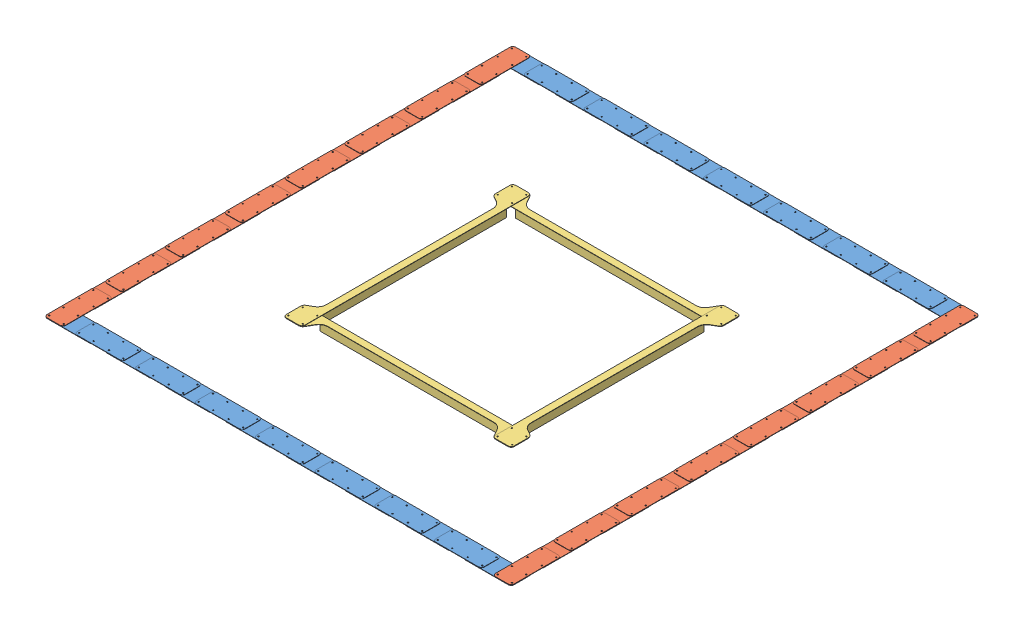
SolidWorks assembly Conct full Array w14x90 20210729 H5.SLDASM, configuration Default (file format 14000). Lengths in mm.
Overall size (17449.89 431.8 17515.17).
176 component instances, 4 part files, 54 mates.
Components (placement in the parent):
- Conct plate w14x90 20210729 H5-2: Conct plate w14x90 20210729 H5.SLDASM [mid frt 1] at (-8378.825 -12.7 8378.825) size (2926.6 25.4 757.52)
  - Plate connect 1 20210527 w193 cH3 H4 H5-1: Plate connect 1 20210527 w193 cH3 H4 H5.SLDPRT [full plate] at (0 -12.7 0) size (1809.42 12.7 757.52)
  - Plate connect 2 20210527 w193 cH3 H4 H5-1: Plate connect 2 20210527 w193 cH3 H4 H5.SLDPRT [full plate] at origin (suppressed, hidden)
  - Plate connect 1 20210527 w193 cH3 H4 H5-2: Plate connect 1 20210527 w193 cH3 H4 H5.SLDPRT [full plate] at (1117.1767 0 0) size (1809.42 12.7 757.52)
  - Shim Plate conct 1 20210527 w193 cH3 H4 H5-2: Shim Plate conct 1 20210527 w193 cH3 H4 H5.SLDPRT [0.5] at (2613.8943 288.3718 -753.4145) (suppressed, hidden)
  - Plate connect 2 20210527 w193 cH3 H4 H5-2: Plate connect 2 20210527 w193 cH3 H4 H5.SLDPRT [full plate] at (0 -12.7 -1117.1767) (suppressed, hidden)
- Conct plate w14x90 20210729 H5-7: Conct plate w14x90 20210729 H5.SLDASM [mid frt 1] at (-6144.4717 -12.7 8378.825) size (2926.6 25.4 757.52)
  - Plate connect 1 20210527 w193 cH3 H4 H5-1: Plate connect 1 20210527 w193 cH3 H4 H5.SLDPRT [full plate] at (0 -12.7 0) size (1809.42 12.7 757.52)
  - Plate connect 2 20210527 w193 cH3 H4 H5-1: Plate connect 2 20210527 w193 cH3 H4 H5.SLDPRT [full plate] at origin (suppressed, hidden)
  - Plate connect 1 20210527 w193 cH3 H4 H5-2: Plate connect 1 20210527 w193 cH3 H4 H5.SLDPRT [full plate] at (1117.1767 0 0) size (1809.42 12.7 757.52)
  - Shim Plate conct 1 20210527 w193 cH3 H4 H5-2: Shim Plate conct 1 20210527 w193 cH3 H4 H5.SLDPRT [0.5] at (2613.8943 288.3718 -753.4145) (suppressed, hidden)
  - Plate connect 2 20210527 w193 cH3 H4 H5-2: Plate connect 2 20210527 w193 cH3 H4 H5.SLDPRT [full plate] at (0 -12.7 -1117.1767) (suppressed, hidden)
- Conct plate w14x90 20210729 H5-8: Conct plate w14x90 20210729 H5.SLDASM [mid frt 1] at (-3910.1183 -12.7 8378.825) size (2926.6 25.4 757.52)
  - Plate connect 1 20210527 w193 cH3 H4 H5-1: Plate connect 1 20210527 w193 cH3 H4 H5.SLDPRT [full plate] at (0 -12.7 0) size (1809.42 12.7 757.52)
  - Plate connect 2 20210527 w193 cH3 H4 H5-1: Plate connect 2 20210527 w193 cH3 H4 H5.SLDPRT [full plate] at origin (suppressed, hidden)
  - Plate connect 1 20210527 w193 cH3 H4 H5-2: Plate connect 1 20210527 w193 cH3 H4 H5.SLDPRT [full plate] at (1117.1767 0 0) size (1809.42 12.7 757.52)
  - Shim Plate conct 1 20210527 w193 cH3 H4 H5-2: Shim Plate conct 1 20210527 w193 cH3 H4 H5.SLDPRT [0.5] at (2613.8943 288.3718 -753.4145) (suppressed, hidden)
  - Plate connect 2 20210527 w193 cH3 H4 H5-2: Plate connect 2 20210527 w193 cH3 H4 H5.SLDPRT [full plate] at (0 -12.7 -1117.1767) (suppressed, hidden)
- Conct plate w14x90 20210729 H5-9: Conct plate w14x90 20210729 H5.SLDASM [mid frt 1] at (-1675.765 -12.7 8378.825) size (2926.6 25.4 757.52)
  - Plate connect 1 20210527 w193 cH3 H4 H5-1: Plate connect 1 20210527 w193 cH3 H4 H5.SLDPRT [full plate] at (0 -12.7 0) size (1809.42 12.7 757.52)
  - Plate connect 2 20210527 w193 cH3 H4 H5-1: Plate connect 2 20210527 w193 cH3 H4 H5.SLDPRT [full plate] at origin (suppressed, hidden)
  - Plate connect 1 20210527 w193 cH3 H4 H5-2: Plate connect 1 20210527 w193 cH3 H4 H5.SLDPRT [full plate] at (1117.1767 0 0) size (1809.42 12.7 757.52)
  - Shim Plate conct 1 20210527 w193 cH3 H4 H5-2: Shim Plate conct 1 20210527 w193 cH3 H4 H5.SLDPRT [0.5] at (2613.8943 288.3718 -753.4145) (suppressed, hidden)
  - Plate connect 2 20210527 w193 cH3 H4 H5-2: Plate connect 2 20210527 w193 cH3 H4 H5.SLDPRT [full plate] at (0 -12.7 -1117.1767) (suppressed, hidden)
- Conct plate w14x90 20210729 H5-10: Conct plate w14x90 20210729 H5.SLDASM [mid frt 1] at (558.5883 -12.7 8378.825) size (2926.6 25.4 757.52)
  - Plate connect 1 20210527 w193 cH3 H4 H5-1: Plate connect 1 20210527 w193 cH3 H4 H5.SLDPRT [full plate] at (0 -12.7 0) size (1809.42 12.7 757.52)
  - Plate connect 2 20210527 w193 cH3 H4 H5-1: Plate connect 2 20210527 w193 cH3 H4 H5.SLDPRT [full plate] at origin (suppressed, hidden)
  - Plate connect 1 20210527 w193 cH3 H4 H5-2: Plate connect 1 20210527 w193 cH3 H4 H5.SLDPRT [full plate] at (1117.1767 0 0) size (1809.42 12.7 757.52)
  - Shim Plate conct 1 20210527 w193 cH3 H4 H5-2: Shim Plate conct 1 20210527 w193 cH3 H4 H5.SLDPRT [0.5] at (2613.8943 288.3718 -753.4145) (suppressed, hidden)
  - Plate connect 2 20210527 w193 cH3 H4 H5-2: Plate connect 2 20210527 w193 cH3 H4 H5.SLDPRT [full plate] at (0 -12.7 -1117.1767) (suppressed, hidden)
- Conct plate w14x90 20210729 H5-11: Conct plate w14x90 20210729 H5.SLDASM [mid frt 1] at (2792.9417 -12.7 8378.825) size (2926.6 25.4 757.52)
  - Plate connect 1 20210527 w193 cH3 H4 H5-1: Plate connect 1 20210527 w193 cH3 H4 H5.SLDPRT [full plate] at (0 -12.7 0) size (1809.42 12.7 757.52)
  - Plate connect 2 20210527 w193 cH3 H4 H5-1: Plate connect 2 20210527 w193 cH3 H4 H5.SLDPRT [full plate] at origin (suppressed, hidden)
  - Plate connect 1 20210527 w193 cH3 H4 H5-2: Plate connect 1 20210527 w193 cH3 H4 H5.SLDPRT [full plate] at (1117.1767 0 0) size (1809.42 12.7 757.52)
  - Shim Plate conct 1 20210527 w193 cH3 H4 H5-2: Shim Plate conct 1 20210527 w193 cH3 H4 H5.SLDPRT [0.5] at (2613.8943 288.3718 -753.4145) (suppressed, hidden)
  - Plate connect 2 20210527 w193 cH3 H4 H5-2: Plate connect 2 20210527 w193 cH3 H4 H5.SLDPRT [full plate] at (0 -12.7 -1117.1767) (suppressed, hidden)
- Conct plate w14x90 20210729 H5-12: Conct plate w14x90 20210729 H5.SLDASM [mid frt 1] at (5027.295 -12.7 8378.825) size (2926.6 25.4 757.52)
  - Plate connect 1 20210527 w193 cH3 H4 H5-1: Plate connect 1 20210527 w193 cH3 H4 H5.SLDPRT [full plate] at (0 -12.7 0) size (1809.42 12.7 757.52)
  - Plate connect 2 20210527 w193 cH3 H4 H5-1: Plate connect 2 20210527 w193 cH3 H4 H5.SLDPRT [full plate] at origin (suppressed, hidden)
  - Plate connect 1 20210527 w193 cH3 H4 H5-2: Plate connect 1 20210527 w193 cH3 H4 H5.SLDPRT [full plate] at (1117.1767 0 0) size (1809.42 12.7 757.52)
  - Shim Plate conct 1 20210527 w193 cH3 H4 H5-2: Shim Plate conct 1 20210527 w193 cH3 H4 H5.SLDPRT [0.5] at (2613.8943 288.3718 -753.4145) (suppressed, hidden)
  - Plate connect 2 20210527 w193 cH3 H4 H5-2: Plate connect 2 20210527 w193 cH3 H4 H5.SLDPRT [full plate] at (0 -12.7 -1117.1767) (suppressed, hidden)
- Plate connect 1 20210527 w193 cH3 H4 H5-1: Plate connect 1 20210527 w193 cH3 H4 H5.SLDPRT [full plate] at (7261.6483 -25.4 8378.825) size (1809.42 12.7 757.52)
- Conct plate w14x90 20210729 H5-19: Conct plate w14x90 20210729 H5.SLDASM [side 1] at (-8378.825 -12.7 8378.825) size (692.24 25.4 2991.88)
  - Plate connect 1 20210527 w193 cH3 H4 H5-1: Plate connect 1 20210527 w193 cH3 H4 H5.SLDPRT [full plate] at (0 -12.7 0) size (1809.42 12.7 757.52) (suppressed, hidden)
  - Plate connect 2 20210527 w193 cH3 H4 H5-1: Plate connect 2 20210527 w193 cH3 H4 H5.SLDPRT [full plate] at origin
  - Plate connect 1 20210527 w193 cH3 H4 H5-2: Plate connect 1 20210527 w193 cH3 H4 H5.SLDPRT [full plate] at (1117.1767 0 0) size (1809.42 12.7 757.52) (suppressed, hidden)
  - Shim Plate conct 1 20210527 w193 cH3 H4 H5-2: Shim Plate conct 1 20210527 w193 cH3 H4 H5.SLDPRT [0.5] at (2613.8943 288.3718 -753.4145) (suppressed, hidden)
  - Plate connect 2 20210527 w193 cH3 H4 H5-2: Plate connect 2 20210527 w193 cH3 H4 H5.SLDPRT [full plate] at (0 -12.7 -1117.1767)
- Conct plate w14x90 20210729 H5-20: Conct plate w14x90 20210729 H5.SLDASM [side 1] at (8378.825 -12.7 8378.825) size (692.24 25.4 2991.88)
  - Plate connect 1 20210527 w193 cH3 H4 H5-1: Plate connect 1 20210527 w193 cH3 H4 H5.SLDPRT [full plate] at (0 -12.7 0) size (1809.42 12.7 757.52) (suppressed, hidden)
  - Plate connect 2 20210527 w193 cH3 H4 H5-1: Plate connect 2 20210527 w193 cH3 H4 H5.SLDPRT [full plate] at origin
  - Plate connect 1 20210527 w193 cH3 H4 H5-2: Plate connect 1 20210527 w193 cH3 H4 H5.SLDPRT [full plate] at (1117.1767 0 0) size (1809.42 12.7 757.52) (suppressed, hidden)
  - Shim Plate conct 1 20210527 w193 cH3 H4 H5-2: Shim Plate conct 1 20210527 w193 cH3 H4 H5.SLDPRT [0.5] at (2613.8943 288.3718 -753.4145) (suppressed, hidden)
  - Plate connect 2 20210527 w193 cH3 H4 H5-2: Plate connect 2 20210527 w193 cH3 H4 H5.SLDPRT [full plate] at (0 -12.7 -1117.1767)
- Conct plate w14x90 20210729 H5-21: Conct plate w14x90 20210729 H5.SLDASM [side 1] at (8378.825 -12.7 6144.4717) size (692.24 25.4 2991.88)
  - Plate connect 1 20210527 w193 cH3 H4 H5-1: Plate connect 1 20210527 w193 cH3 H4 H5.SLDPRT [full plate] at (0 -12.7 0) size (1809.42 12.7 757.52) (suppressed, hidden)
  - Plate connect 2 20210527 w193 cH3 H4 H5-1: Plate connect 2 20210527 w193 cH3 H4 H5.SLDPRT [full plate] at origin
  - Plate connect 1 20210527 w193 cH3 H4 H5-2: Plate connect 1 20210527 w193 cH3 H4 H5.SLDPRT [full plate] at (1117.1767 0 0) size (1809.42 12.7 757.52) (suppressed, hidden)
  - Shim Plate conct 1 20210527 w193 cH3 H4 H5-2: Shim Plate conct 1 20210527 w193 cH3 H4 H5.SLDPRT [0.5] at (2613.8943 288.3718 -753.4145) (suppressed, hidden)
  - Plate connect 2 20210527 w193 cH3 H4 H5-2: Plate connect 2 20210527 w193 cH3 H4 H5.SLDPRT [full plate] at (0 -12.7 -1117.1767)
- Conct plate w14x90 20210729 H5-22: Conct plate w14x90 20210729 H5.SLDASM [side 1] at (8378.825 -12.7 3910.1183) size (692.24 25.4 2991.88)
  - Plate connect 1 20210527 w193 cH3 H4 H5-1: Plate connect 1 20210527 w193 cH3 H4 H5.SLDPRT [full plate] at (0 -12.7 0) size (1809.42 12.7 757.52) (suppressed, hidden)
  - Plate connect 2 20210527 w193 cH3 H4 H5-1: Plate connect 2 20210527 w193 cH3 H4 H5.SLDPRT [full plate] at origin
  - Plate connect 1 20210527 w193 cH3 H4 H5-2: Plate connect 1 20210527 w193 cH3 H4 H5.SLDPRT [full plate] at (1117.1767 0 0) size (1809.42 12.7 757.52) (suppressed, hidden)
  - Shim Plate conct 1 20210527 w193 cH3 H4 H5-2: Shim Plate conct 1 20210527 w193 cH3 H4 H5.SLDPRT [0.5] at (2613.8943 288.3718 -753.4145) (suppressed, hidden)
  - Plate connect 2 20210527 w193 cH3 H4 H5-2: Plate connect 2 20210527 w193 cH3 H4 H5.SLDPRT [full plate] at (0 -12.7 -1117.1767)
- Conct plate w14x90 20210729 H5-23: Conct plate w14x90 20210729 H5.SLDASM [side 1] at (8378.825 -12.7 1675.765) size (692.24 25.4 2991.88)
  - Plate connect 1 20210527 w193 cH3 H4 H5-1: Plate connect 1 20210527 w193 cH3 H4 H5.SLDPRT [full plate] at (0 -12.7 0) size (1809.42 12.7 757.52) (suppressed, hidden)
  - Plate connect 2 20210527 w193 cH3 H4 H5-1: Plate connect 2 20210527 w193 cH3 H4 H5.SLDPRT [full plate] at origin
  - Plate connect 1 20210527 w193 cH3 H4 H5-2: Plate connect 1 20210527 w193 cH3 H4 H5.SLDPRT [full plate] at (1117.1767 0 0) size (1809.42 12.7 757.52) (suppressed, hidden)
  - Shim Plate conct 1 20210527 w193 cH3 H4 H5-2: Shim Plate conct 1 20210527 w193 cH3 H4 H5.SLDPRT [0.5] at (2613.8943 288.3718 -753.4145) (suppressed, hidden)
  - Plate connect 2 20210527 w193 cH3 H4 H5-2: Plate connect 2 20210527 w193 cH3 H4 H5.SLDPRT [full plate] at (0 -12.7 -1117.1767)
- Conct plate w14x90 20210729 H5-24: Conct plate w14x90 20210729 H5.SLDASM [side 1] at (8378.825 -12.7 -558.5883) size (692.24 25.4 2991.88)
  - Plate connect 1 20210527 w193 cH3 H4 H5-1: Plate connect 1 20210527 w193 cH3 H4 H5.SLDPRT [full plate] at (0 -12.7 0) size (1809.42 12.7 757.52) (suppressed, hidden)
  - Plate connect 2 20210527 w193 cH3 H4 H5-1: Plate connect 2 20210527 w193 cH3 H4 H5.SLDPRT [full plate] at origin
  - Plate connect 1 20210527 w193 cH3 H4 H5-2: Plate connect 1 20210527 w193 cH3 H4 H5.SLDPRT [full plate] at (1117.1767 0 0) size (1809.42 12.7 757.52) (suppressed, hidden)
  - Shim Plate conct 1 20210527 w193 cH3 H4 H5-2: Shim Plate conct 1 20210527 w193 cH3 H4 H5.SLDPRT [0.5] at (2613.8943 288.3718 -753.4145) (suppressed, hidden)
  - Plate connect 2 20210527 w193 cH3 H4 H5-2: Plate connect 2 20210527 w193 cH3 H4 H5.SLDPRT [full plate] at (0 -12.7 -1117.1767)
- Conct plate w14x90 20210729 H5-25: Conct plate w14x90 20210729 H5.SLDASM [side 1] at (8378.825 -12.7 -2792.9417) size (692.24 25.4 2991.88)
  - Plate connect 1 20210527 w193 cH3 H4 H5-1: Plate connect 1 20210527 w193 cH3 H4 H5.SLDPRT [full plate] at (0 -12.7 0) size (1809.42 12.7 757.52) (suppressed, hidden)
  - Plate connect 2 20210527 w193 cH3 H4 H5-1: Plate connect 2 20210527 w193 cH3 H4 H5.SLDPRT [full plate] at origin
  - Plate connect 1 20210527 w193 cH3 H4 H5-2: Plate connect 1 20210527 w193 cH3 H4 H5.SLDPRT [full plate] at (1117.1767 0 0) size (1809.42 12.7 757.52) (suppressed, hidden)
  - Shim Plate conct 1 20210527 w193 cH3 H4 H5-2: Shim Plate conct 1 20210527 w193 cH3 H4 H5.SLDPRT [0.5] at (2613.8943 288.3718 -753.4145) (suppressed, hidden)
  - Plate connect 2 20210527 w193 cH3 H4 H5-2: Plate connect 2 20210527 w193 cH3 H4 H5.SLDPRT [full plate] at (0 -12.7 -1117.1767)
- Conct plate w14x90 20210729 H5-26: Conct plate w14x90 20210729 H5.SLDASM [side 1] at (8378.825 -12.7 -5027.295) size (692.24 25.4 2991.88)
  - Plate connect 1 20210527 w193 cH3 H4 H5-1: Plate connect 1 20210527 w193 cH3 H4 H5.SLDPRT [full plate] at (0 -12.7 0) size (1809.42 12.7 757.52) (suppressed, hidden)
  - Plate connect 2 20210527 w193 cH3 H4 H5-1: Plate connect 2 20210527 w193 cH3 H4 H5.SLDPRT [full plate] at origin
  - Plate connect 1 20210527 w193 cH3 H4 H5-2: Plate connect 1 20210527 w193 cH3 H4 H5.SLDPRT [full plate] at (1117.1767 0 0) size (1809.42 12.7 757.52) (suppressed, hidden)
  - Shim Plate conct 1 20210527 w193 cH3 H4 H5-2: Shim Plate conct 1 20210527 w193 cH3 H4 H5.SLDPRT [0.5] at (2613.8943 288.3718 -753.4145) (suppressed, hidden)
  - Plate connect 2 20210527 w193 cH3 H4 H5-2: Plate connect 2 20210527 w193 cH3 H4 H5.SLDPRT [full plate] at (0 -12.7 -1117.1767)
- Conct plate w14x90 20210729 H5-27: Conct plate w14x90 20210729 H5.SLDASM [side 1] at (-8378.825 -12.7 6144.4717) size (692.24 25.4 2991.88)
  - Plate connect 1 20210527 w193 cH3 H4 H5-1: Plate connect 1 20210527 w193 cH3 H4 H5.SLDPRT [full plate] at (0 -12.7 0) size (1809.42 12.7 757.52) (suppressed, hidden)
  - Plate connect 2 20210527 w193 cH3 H4 H5-1: Plate connect 2 20210527 w193 cH3 H4 H5.SLDPRT [full plate] at origin
  - Plate connect 1 20210527 w193 cH3 H4 H5-2: Plate connect 1 20210527 w193 cH3 H4 H5.SLDPRT [full plate] at (1117.1767 0 0) size (1809.42 12.7 757.52) (suppressed, hidden)
  - Shim Plate conct 1 20210527 w193 cH3 H4 H5-2: Shim Plate conct 1 20210527 w193 cH3 H4 H5.SLDPRT [0.5] at (2613.8943 288.3718 -753.4145) (suppressed, hidden)
  - Plate connect 2 20210527 w193 cH3 H4 H5-2: Plate connect 2 20210527 w193 cH3 H4 H5.SLDPRT [full plate] at (0 -12.7 -1117.1767)
- Conct plate w14x90 20210729 H5-28: Conct plate w14x90 20210729 H5.SLDASM [side 1] at (-8378.825 -12.7 3910.1183) size (692.24 25.4 2991.88)
  - Plate connect 1 20210527 w193 cH3 H4 H5-1: Plate connect 1 20210527 w193 cH3 H4 H5.SLDPRT [full plate] at (0 -12.7 0) size (1809.42 12.7 757.52) (suppressed, hidden)
  - Plate connect 2 20210527 w193 cH3 H4 H5-1: Plate connect 2 20210527 w193 cH3 H4 H5.SLDPRT [full plate] at origin
  - Plate connect 1 20210527 w193 cH3 H4 H5-2: Plate connect 1 20210527 w193 cH3 H4 H5.SLDPRT [full plate] at (1117.1767 0 0) size (1809.42 12.7 757.52) (suppressed, hidden)
  - Shim Plate conct 1 20210527 w193 cH3 H4 H5-2: Shim Plate conct 1 20210527 w193 cH3 H4 H5.SLDPRT [0.5] at (2613.8943 288.3718 -753.4145) (suppressed, hidden)
  - Plate connect 2 20210527 w193 cH3 H4 H5-2: Plate connect 2 20210527 w193 cH3 H4 H5.SLDPRT [full plate] at (0 -12.7 -1117.1767)
- Conct plate w14x90 20210729 H5-29: Conct plate w14x90 20210729 H5.SLDASM [side 1] at (-8378.825 -12.7 1675.765) size (692.24 25.4 2991.88)
  - Plate connect 1 20210527 w193 cH3 H4 H5-1: Plate connect 1 20210527 w193 cH3 H4 H5.SLDPRT [full plate] at (0 -12.7 0) size (1809.42 12.7 757.52) (suppressed, hidden)
  - Plate connect 2 20210527 w193 cH3 H4 H5-1: Plate connect 2 20210527 w193 cH3 H4 H5.SLDPRT [full plate] at origin
  - Plate connect 1 20210527 w193 cH3 H4 H5-2: Plate connect 1 20210527 w193 cH3 H4 H5.SLDPRT [full plate] at (1117.1767 0 0) size (1809.42 12.7 757.52) (suppressed, hidden)
  - Shim Plate conct 1 20210527 w193 cH3 H4 H5-2: Shim Plate conct 1 20210527 w193 cH3 H4 H5.SLDPRT [0.5] at (2613.8943 288.3718 -753.4145) (suppressed, hidden)
  - Plate connect 2 20210527 w193 cH3 H4 H5-2: Plate connect 2 20210527 w193 cH3 H4 H5.SLDPRT [full plate] at (0 -12.7 -1117.1767)
- Conct plate w14x90 20210729 H5-30: Conct plate w14x90 20210729 H5.SLDASM [side 1] at (-8378.825 -12.7 -558.5883) size (692.24 25.4 2991.88)
  - Plate connect 1 20210527 w193 cH3 H4 H5-1: Plate connect 1 20210527 w193 cH3 H4 H5.SLDPRT [full plate] at (0 -12.7 0) size (1809.42 12.7 757.52) (suppressed, hidden)
  - Plate connect 2 20210527 w193 cH3 H4 H5-1: Plate connect 2 20210527 w193 cH3 H4 H5.SLDPRT [full plate] at origin
  - Plate connect 1 20210527 w193 cH3 H4 H5-2: Plate connect 1 20210527 w193 cH3 H4 H5.SLDPRT [full plate] at (1117.1767 0 0) size (1809.42 12.7 757.52) (suppressed, hidden)
  - Shim Plate conct 1 20210527 w193 cH3 H4 H5-2: Shim Plate conct 1 20210527 w193 cH3 H4 H5.SLDPRT [0.5] at (2613.8943 288.3718 -753.4145) (suppressed, hidden)
  - Plate connect 2 20210527 w193 cH3 H4 H5-2: Plate connect 2 20210527 w193 cH3 H4 H5.SLDPRT [full plate] at (0 -12.7 -1117.1767)
- Conct plate w14x90 20210729 H5-31: Conct plate w14x90 20210729 H5.SLDASM [side 1] at (-8378.825 -12.7 -2792.9417) size (692.24 25.4 2991.88)
  - Plate connect 1 20210527 w193 cH3 H4 H5-1: Plate connect 1 20210527 w193 cH3 H4 H5.SLDPRT [full plate] at (0 -12.7 0) size (1809.42 12.7 757.52) (suppressed, hidden)
  - Plate connect 2 20210527 w193 cH3 H4 H5-1: Plate connect 2 20210527 w193 cH3 H4 H5.SLDPRT [full plate] at origin
  - Plate connect 1 20210527 w193 cH3 H4 H5-2: Plate connect 1 20210527 w193 cH3 H4 H5.SLDPRT [full plate] at (1117.1767 0 0) size (1809.42 12.7 757.52) (suppressed, hidden)
  - Shim Plate conct 1 20210527 w193 cH3 H4 H5-2: Shim Plate conct 1 20210527 w193 cH3 H4 H5.SLDPRT [0.5] at (2613.8943 288.3718 -753.4145) (suppressed, hidden)
  - Plate connect 2 20210527 w193 cH3 H4 H5-2: Plate connect 2 20210527 w193 cH3 H4 H5.SLDPRT [full plate] at (0 -12.7 -1117.1767)
- Conct plate w14x90 20210729 H5-32: Conct plate w14x90 20210729 H5.SLDASM [side 1] at (-8378.825 -12.7 -5027.295) size (692.24 25.4 2991.88)
  - Plate connect 1 20210527 w193 cH3 H4 H5-1: Plate connect 1 20210527 w193 cH3 H4 H5.SLDPRT [full plate] at (0 -12.7 0) size (1809.42 12.7 757.52) (suppressed, hidden)
  - Plate connect 2 20210527 w193 cH3 H4 H5-1: Plate connect 2 20210527 w193 cH3 H4 H5.SLDPRT [full plate] at origin
  - Plate connect 1 20210527 w193 cH3 H4 H5-2: Plate connect 1 20210527 w193 cH3 H4 H5.SLDPRT [full plate] at (1117.1767 0 0) size (1809.42 12.7 757.52) (suppressed, hidden)
  - Shim Plate conct 1 20210527 w193 cH3 H4 H5-2: Shim Plate conct 1 20210527 w193 cH3 H4 H5.SLDPRT [0.5] at (2613.8943 288.3718 -753.4145) (suppressed, hidden)
  - Plate connect 2 20210527 w193 cH3 H4 H5-2: Plate connect 2 20210527 w193 cH3 H4 H5.SLDPRT [full plate] at (0 -12.7 -1117.1767)
- Plate connect 2 20210527 w193 cH3 H4 H5-1: Plate connect 2 20210527 w193 cH3 H4 H5.SLDPRT [full plate] at (-8378.825 -12.7 -7261.6483)
- Plate connect 2 20210527 w193 cH3 H4 H5-2: Plate connect 2 20210527 w193 cH3 H4 H5.SLDPRT [full plate] at (8378.825 -12.7 -7261.6483)
- Conct plate w14x90 20210729 H5-33: Conct plate w14x90 20210729 H5.SLDASM [mid frt 1] at (-8378.825 -12.7 -8378.825) size (2926.6 25.4 757.52)
  - Plate connect 1 20210527 w193 cH3 H4 H5-1: Plate connect 1 20210527 w193 cH3 H4 H5.SLDPRT [full plate] at (0 -12.7 0) size (1809.42 12.7 757.52)
  - Plate connect 2 20210527 w193 cH3 H4 H5-1: Plate connect 2 20210527 w193 cH3 H4 H5.SLDPRT [full plate] at origin (suppressed, hidden)
  - Plate connect 1 20210527 w193 cH3 H4 H5-2: Plate connect 1 20210527 w193 cH3 H4 H5.SLDPRT [full plate] at (1117.1767 0 0) size (1809.42 12.7 757.52)
  - Shim Plate conct 1 20210527 w193 cH3 H4 H5-2: Shim Plate conct 1 20210527 w193 cH3 H4 H5.SLDPRT [0.5] at (2613.8943 288.3718 -753.4145) (suppressed, hidden)
  - Plate connect 2 20210527 w193 cH3 H4 H5-2: Plate connect 2 20210527 w193 cH3 H4 H5.SLDPRT [full plate] at (0 -12.7 -1117.1767) (suppressed, hidden)
- Conct plate w14x90 20210729 H5-34: Conct plate w14x90 20210729 H5.SLDASM [mid frt 1] at (-6144.4717 -12.7 -8378.825) size (2926.6 25.4 757.52)
  - Plate connect 1 20210527 w193 cH3 H4 H5-1: Plate connect 1 20210527 w193 cH3 H4 H5.SLDPRT [full plate] at (0 -12.7 0) size (1809.42 12.7 757.52)
  - Plate connect 2 20210527 w193 cH3 H4 H5-1: Plate connect 2 20210527 w193 cH3 H4 H5.SLDPRT [full plate] at origin (suppressed, hidden)
  - Plate connect 1 20210527 w193 cH3 H4 H5-2: Plate connect 1 20210527 w193 cH3 H4 H5.SLDPRT [full plate] at (1117.1767 0 0) size (1809.42 12.7 757.52)
  - Shim Plate conct 1 20210527 w193 cH3 H4 H5-2: Shim Plate conct 1 20210527 w193 cH3 H4 H5.SLDPRT [0.5] at (2613.8943 288.3718 -753.4145) (suppressed, hidden)
  - Plate connect 2 20210527 w193 cH3 H4 H5-2: Plate connect 2 20210527 w193 cH3 H4 H5.SLDPRT [full plate] at (0 -12.7 -1117.1767) (suppressed, hidden)
- Conct plate w14x90 20210729 H5-35: Conct plate w14x90 20210729 H5.SLDASM [mid frt 1] at (-3910.1183 -12.7 -8378.825) size (2926.6 25.4 757.52)
  - Plate connect 1 20210527 w193 cH3 H4 H5-1: Plate connect 1 20210527 w193 cH3 H4 H5.SLDPRT [full plate] at (0 -12.7 0) size (1809.42 12.7 757.52)
  - Plate connect 2 20210527 w193 cH3 H4 H5-1: Plate connect 2 20210527 w193 cH3 H4 H5.SLDPRT [full plate] at origin (suppressed, hidden)
  - Plate connect 1 20210527 w193 cH3 H4 H5-2: Plate connect 1 20210527 w193 cH3 H4 H5.SLDPRT [full plate] at (1117.1767 0 0) size (1809.42 12.7 757.52)
  - Shim Plate conct 1 20210527 w193 cH3 H4 H5-2: Shim Plate conct 1 20210527 w193 cH3 H4 H5.SLDPRT [0.5] at (2613.8943 288.3718 -753.4145) (suppressed, hidden)
  - Plate connect 2 20210527 w193 cH3 H4 H5-2: Plate connect 2 20210527 w193 cH3 H4 H5.SLDPRT [full plate] at (0 -12.7 -1117.1767) (suppressed, hidden)
- Conct plate w14x90 20210729 H5-36: Conct plate w14x90 20210729 H5.SLDASM [mid frt 1] at (-1675.765 -12.7 -8378.825) size (2926.6 25.4 757.52)
  - Plate connect 1 20210527 w193 cH3 H4 H5-1: Plate connect 1 20210527 w193 cH3 H4 H5.SLDPRT [full plate] at (0 -12.7 0) size (1809.42 12.7 757.52)
  - Plate connect 2 20210527 w193 cH3 H4 H5-1: Plate connect 2 20210527 w193 cH3 H4 H5.SLDPRT [full plate] at origin (suppressed, hidden)
  - Plate connect 1 20210527 w193 cH3 H4 H5-2: Plate connect 1 20210527 w193 cH3 H4 H5.SLDPRT [full plate] at (1117.1767 0 0) size (1809.42 12.7 757.52)
  - Shim Plate conct 1 20210527 w193 cH3 H4 H5-2: Shim Plate conct 1 20210527 w193 cH3 H4 H5.SLDPRT [0.5] at (2613.8943 288.3718 -753.4145) (suppressed, hidden)
  - Plate connect 2 20210527 w193 cH3 H4 H5-2: Plate connect 2 20210527 w193 cH3 H4 H5.SLDPRT [full plate] at (0 -12.7 -1117.1767) (suppressed, hidden)
- Conct plate w14x90 20210729 H5-37: Conct plate w14x90 20210729 H5.SLDASM [mid frt 1] at (558.5883 -12.7 -8378.825) size (2926.6 25.4 757.52)
  - Plate connect 1 20210527 w193 cH3 H4 H5-1: Plate connect 1 20210527 w193 cH3 H4 H5.SLDPRT [full plate] at (0 -12.7 0) size (1809.42 12.7 757.52)
  - Plate connect 2 20210527 w193 cH3 H4 H5-1: Plate connect 2 20210527 w193 cH3 H4 H5.SLDPRT [full plate] at origin (suppressed, hidden)
  - Plate connect 1 20210527 w193 cH3 H4 H5-2: Plate connect 1 20210527 w193 cH3 H4 H5.SLDPRT [full plate] at (1117.1767 0 0) size (1809.42 12.7 757.52)
  - Shim Plate conct 1 20210527 w193 cH3 H4 H5-2: Shim Plate conct 1 20210527 w193 cH3 H4 H5.SLDPRT [0.5] at (2613.8943 288.3718 -753.4145) (suppressed, hidden)
  - Plate connect 2 20210527 w193 cH3 H4 H5-2: Plate connect 2 20210527 w193 cH3 H4 H5.SLDPRT [full plate] at (0 -12.7 -1117.1767) (suppressed, hidden)
- Conct plate w14x90 20210729 H5-38: Conct plate w14x90 20210729 H5.SLDASM [mid frt 1] at (2792.9417 -12.7 -8378.825) size (2926.6 25.4 757.52)
  - Plate connect 1 20210527 w193 cH3 H4 H5-1: Plate connect 1 20210527 w193 cH3 H4 H5.SLDPRT [full plate] at (0 -12.7 0) size (1809.42 12.7 757.52)
  - Plate connect 2 20210527 w193 cH3 H4 H5-1: Plate connect 2 20210527 w193 cH3 H4 H5.SLDPRT [full plate] at origin (suppressed, hidden)
  - Plate connect 1 20210527 w193 cH3 H4 H5-2: Plate connect 1 20210527 w193 cH3 H4 H5.SLDPRT [full plate] at (1117.1767 0 0) size (1809.42 12.7 757.52)
  - Shim Plate conct 1 20210527 w193 cH3 H4 H5-2: Shim Plate conct 1 20210527 w193 cH3 H4 H5.SLDPRT [0.5] at (2613.8943 288.3718 -753.4145) (suppressed, hidden)
  - Plate connect 2 20210527 w193 cH3 H4 H5-2: Plate connect 2 20210527 w193 cH3 H4 H5.SLDPRT [full plate] at (0 -12.7 -1117.1767) (suppressed, hidden)
- Conct plate w14x90 20210729 H5-39: Conct plate w14x90 20210729 H5.SLDASM [mid frt 1] at (5027.295 -12.7 -8378.825) size (2926.6 25.4 757.52)
  - Plate connect 1 20210527 w193 cH3 H4 H5-1: Plate connect 1 20210527 w193 cH3 H4 H5.SLDPRT [full plate] at (0 -12.7 0) size (1809.42 12.7 757.52)
  - Plate connect 2 20210527 w193 cH3 H4 H5-1: Plate connect 2 20210527 w193 cH3 H4 H5.SLDPRT [full plate] at origin (suppressed, hidden)
  - Plate connect 1 20210527 w193 cH3 H4 H5-2: Plate connect 1 20210527 w193 cH3 H4 H5.SLDPRT [full plate] at (1117.1767 0 0) size (1809.42 12.7 757.52)
  - Shim Plate conct 1 20210527 w193 cH3 H4 H5-2: Shim Plate conct 1 20210527 w193 cH3 H4 H5.SLDPRT [0.5] at (2613.8943 288.3718 -753.4145) (suppressed, hidden)
  - Plate connect 2 20210527 w193 cH3 H4 H5-2: Plate connect 2 20210527 w193 cH3 H4 H5.SLDPRT [full plate] at (0 -12.7 -1117.1767) (suppressed, hidden)
- Plate connect 1 20210527 w193 cH3 H4 H5-2: Plate connect 1 20210527 w193 cH3 H4 H5.SLDPRT [full plate] at (7261.6483 -25.4 -8378.825) size (1809.42 12.7 757.52)
- Conct inner 1 20210729 H5-1: Conct inner 1 20210729 H5.SLDPRT [frnt bk] at (0 -25.4 0) size (8512.48 419.1 757.52)
- Conct inner 1 20210729 H5-2: Conct inner 1 20210729 H5.SLDPRT [frnt bk] at (0 -25.4 0) x (-1 0 0) z (0 0 -1) size (8512.48 419.1 757.52)
- Conct inner 1 20210729 H5-3: Conct inner 1 20210729 H5.SLDPRT [side] at (0 -12.7 0) size (692.24 419.1 8577.76)
- Conct inner 1 20210729 H5-4: Conct inner 1 20210729 H5.SLDPRT [side] at (0 -12.7 0) x (-1 0 0) z (0 0 -1) size (692.24 419.1 8577.76)
Mates (geometry in assembly coordinates):
- Coincident6: coincident aligned: plane of Conct plate w14x90 20210729-2/Plate connect 1 20210527 w193 cH3 H4-2 through (-7261.6483 0 8378.825) normal (0 1 0)
- Coincident7: coincident aligned: plane of Conct plate w14x90 20210729-2 through (-8378.825 -12.7 8378.825) normal (0 0 1)
- Coincident8: coincident aligned: plane of Conct plate w14x90 20210729-2 through (-8378.825 -12.7 8378.825) normal (1 0 0)
- Coincident9: coincident anti-aligned: plane of Conct plate w14x90 20210729-2/Plate connect 1 20210527 w193 cH3 H4-2 through (-7261.6483 -12.7 8378.825) normal (0 -1 0); plane of Conct plate w14x90 20210729-7/Plate connect 1 20210527 w193 cH3 H4-1 through (-6144.4717 -12.7 8378.825) normal (0 1 0)
- Concentric3: concentric aligned: cylinder of Conct plate w14x90 20210729-2/Plate connect 1 20210527 w193 cH3 H4-2 through (-6414.3939 89.8026 8111.8238) axis (0 -1 0) radius 22.225; cylinder of Conct plate w14x90 20210729-7/Plate connect 1 20210527 w193 cH3 H4-1 through (-6414.3939 77.1026 8111.8238) axis (0 -1 0) radius 22.225
- Concentric4: concentric aligned: cylinder of Conct plate w14x90 20210729-2/Plate connect 1 20210527 w193 cH3 H4-2 through (-5874.5495 89.8026 8111.8238) axis (0 -1 0) radius 22.225; cylinder of Conct plate w14x90 20210729-7/Plate connect 1 20210527 w193 cH3 H4-1 through (-5874.5495 77.1026 8111.8238) axis (0 -1 0) radius 22.225
- Coincident10: coincident anti-aligned: plane of Conct plate w14x90 20210729-7/Plate connect 1 20210527 w193 cH3 H4-2 through (-5027.295 -12.7 8378.825) normal (0 -1 0); plane of Conct plate w14x90 20210729-8/Plate connect 1 20210527 w193 cH3 H4-1 through (-3910.1183 -12.7 8378.825) normal (0 1 0)
- Concentric5: concentric aligned: cylinder of Conct plate w14x90 20210729-7/Plate connect 1 20210527 w193 cH3 H4-2 through (-4180.0405 89.8026 8645.8262) axis (0 -1 0) radius 22.225; cylinder of Conct plate w14x90 20210729-8/Plate connect 1 20210527 w193 cH3 H4-1 through (-4180.0405 77.1026 8645.8262) axis (0 -1 0) radius 22.225
- Concentric6: concentric aligned: cylinder of Conct plate w14x90 20210729-7/Plate connect 1 20210527 w193 cH3 H4-2 through (-3640.1961 89.8026 8645.8262) axis (0 -1 0) radius 22.225; cylinder of Conct plate w14x90 20210729-8/Plate connect 1 20210527 w193 cH3 H4-1 through (-3640.1961 77.1026 8645.8262) axis (0 -1 0) radius 22.225
- Coincident11: coincident anti-aligned: plane of Conct plate w14x90 20210729-8/Plate connect 1 20210527 w193 cH3 H4-2 through (-2792.9417 -12.7 8378.825) normal (0 -1 0); plane of Conct plate w14x90 20210729-9/Plate connect 1 20210527 w193 cH3 H4-1 through (-1675.765 -12.7 8378.825) normal (0 1 0)
- Concentric7: concentric aligned: cylinder of Conct plate w14x90 20210729-8/Plate connect 1 20210527 w193 cH3 H4-2 through (-1945.6872 89.8026 8645.8262) axis (0 -1 0) radius 22.225; cylinder of Conct plate w14x90 20210729-9/Plate connect 1 20210527 w193 cH3 H4-1 through (-1945.6872 77.1026 8645.8262) axis (0 -1 0) radius 22.225
- Concentric8: concentric aligned: cylinder of Conct plate w14x90 20210729-8/Plate connect 1 20210527 w193 cH3 H4-2 through (-1405.8428 89.8026 8111.8238) axis (0 -1 0) radius 22.225; cylinder of Conct plate w14x90 20210729-9/Plate connect 1 20210527 w193 cH3 H4-1 through (-1405.8428 77.1026 8111.8238) axis (0 -1 0) radius 22.225
- Coincident12: coincident anti-aligned: plane of Conct plate w14x90 20210729-9/Plate connect 1 20210527 w193 cH3 H4-2 through (-558.5883 -12.7 8378.825) normal (0 -1 0); plane of Conct plate w14x90 20210729-10/Plate connect 1 20210527 w193 cH3 H4-1 through (558.5883 -12.7 8378.825) normal (0 1 0)
- Concentric9: concentric aligned: cylinder of Conct plate w14x90 20210729-9/Plate connect 1 20210527 w193 cH3 H4-2 through (288.6661 89.8026 8111.8238) axis (0 -1 0) radius 22.225; cylinder of Conct plate w14x90 20210729-10/Plate connect 1 20210527 w193 cH3 H4-1 through (288.6661 77.1026 8111.8238) axis (0 -1 0) radius 22.225
- Concentric10: concentric aligned: cylinder of Conct plate w14x90 20210729-9/Plate connect 1 20210527 w193 cH3 H4-2 through (828.5105 89.8026 8645.8262) axis (0 -1 0) radius 22.225; cylinder of Conct plate w14x90 20210729-10/Plate connect 1 20210527 w193 cH3 H4-1 through (828.5105 77.1026 8645.8262) axis (0 -1 0) radius 22.225
- Coincident13: coincident anti-aligned: plane of Conct plate w14x90 20210729-10/Plate connect 1 20210527 w193 cH3 H4-2 through (1675.765 -12.7 8378.825) normal (0 -1 0); plane of Conct plate w14x90 20210729-11/Plate connect 1 20210527 w193 cH3 H4-1 through (2792.9417 -12.7 8378.825) normal (0 1 0)
- Concentric11: concentric aligned: cylinder of Conct plate w14x90 20210729-10/Plate connect 1 20210527 w193 cH3 H4-2 through (2523.0195 89.8026 8645.8262) axis (0 -1 0) radius 22.225; cylinder of Conct plate w14x90 20210729-11/Plate connect 1 20210527 w193 cH3 H4-1 through (2523.0195 77.1026 8645.8262) axis (0 -1 0) radius 22.225
- Concentric12: concentric aligned: cylinder of Conct plate w14x90 20210729-10/Plate connect 1 20210527 w193 cH3 H4-2 through (3062.8639 89.8026 8111.8238) axis (0 -1 0) radius 22.225; cylinder of Conct plate w14x90 20210729-11/Plate connect 1 20210527 w193 cH3 H4-1 through (3062.8639 77.1026 8111.8238) axis (0 -1 0) radius 22.225
- Coincident14: coincident anti-aligned: plane of Conct plate w14x90 20210729-11/Plate connect 1 20210527 w193 cH3 H4-2 through (3910.1183 -12.7 8378.825) normal (0 -1 0); plane of Conct plate w14x90 20210729-12/Plate connect 1 20210527 w193 cH3 H4-1 through (5027.295 -12.7 8378.825) normal (0 1 0)
- Concentric13: concentric aligned: cylinder of Conct plate w14x90 20210729-11/Plate connect 1 20210527 w193 cH3 H4-2 through (4757.3728 89.8026 8111.8238) axis (0 -1 0) radius 22.225; cylinder of Conct plate w14x90 20210729-12/Plate connect 1 20210527 w193 cH3 H4-1 through (4757.3728 77.1026 8111.8238) axis (0 -1 0) radius 22.225
- Concentric14: concentric aligned: cylinder of Conct plate w14x90 20210729-11/Plate connect 1 20210527 w193 cH3 H4-2 through (5297.2172 89.8026 8111.8238) axis (0 -1 0) radius 22.225; cylinder of Conct plate w14x90 20210729-12/Plate connect 1 20210527 w193 cH3 H4-1 through (5297.2172 77.1026 8111.8238) axis (0 -1 0) radius 22.225
- Coincident15: coincident anti-aligned: plane of Conct plate w14x90 20210729-12/Plate connect 1 20210527 w193 cH3 H4-2 through (6144.4717 -12.7 8378.825) normal (0 -1 0); plane of Plate connect 1 20210527 w193 cH3 H4-1 through (7261.6483 -12.7 8378.825) normal (0 1 0)
- Concentric15: concentric aligned: cylinder of Conct plate w14x90 20210729-12/Plate connect 1 20210527 w193 cH3 H4-2 through (6991.7261 89.8026 8645.8262) axis (0 -1 0) radius 22.225; cylinder of Plate connect 1 20210527 w193 cH3 H4-1 through (6991.7261 77.1026 8645.8262) axis (0 -1 0) radius 22.225
- Concentric16: concentric aligned: cylinder of Conct plate w14x90 20210729-12/Plate connect 1 20210527 w193 cH3 H4-2 through (7531.5705 89.8026 8111.8238) axis (0 -1 0) radius 22.225; cylinder of Plate connect 1 20210527 w193 cH3 H4-1 through (7531.5705 77.1026 8111.8238) axis (0 -1 0) radius 22.225
- Coincident16: coincident anti-aligned: plane of Conct plate w14x90 20210729-2/Plate connect 1 20210527 w193 cH3 H4-1 through (-8378.825 -12.7 8378.825) normal (0 1 0); plane of Conct plate w14x90 20210729-19/Plate connect 2 20210527 w193 cH3 H4-1 through (-8378.825 -12.7 8378.825) normal (0 -1 0)
- Coincident17: coincident aligned: plane of Conct plate w14x90 20210729-19 through (-8378.825 -12.7 8378.825) normal (0 0 1)
- Coincident18: coincident aligned: plane of Conct plate w14x90 20210729-19 through (-8378.825 -12.7 8378.825) normal (1 0 0)
- Coincident19: coincident anti-aligned: plane of Plate connect 1 20210527 w193 cH3 H4-1 through (7261.6483 -12.7 8378.825) normal (0 1 0); plane of Conct plate w14x90 20210729-20/Plate connect 2 20210527 w193 cH3 H4-1 through (8378.825 -12.7 8378.825) normal (0 -1 0)
- Concentric17: concentric aligned: cylinder of Plate connect 1 20210527 w193 cH3 H4-1 through (8648.7472 77.1026 8645.8262) axis (0 -1 0) radius 22.225; cylinder of Conct plate w14x90 20210729-20/Plate connect 2 20210527 w193 cH3 H4-1 through (8648.7472 89.8026 8645.8262) axis (0 -1 0) radius 22.225
- Concentric18: concentric aligned: cylinder of Plate connect 1 20210527 w193 cH3 H4-1 through (8108.9028 77.1026 8111.8238) axis (0 -1 0) radius 22.225; cylinder of Conct plate w14x90 20210729-20/Plate connect 2 20210527 w193 cH3 H4-1 through (8108.9028 89.8026 8111.8238) axis (0 -1 0) radius 22.225
- Coincident20: coincident anti-aligned: plane of Conct plate w14x90 20210729-32/Plate connect 2 20210527 w193 cH3 H4-2 through (-8378.825 -12.7 -6144.4717) normal (0 1 0); plane of Plate connect 2 20210527 w193 cH3 H4-1 through (-8378.825 -12.7 -7261.6483) normal (0 -1 0)
- Concentric19: concentric aligned: cylinder of Conct plate w14x90 20210729-32/Plate connect 2 20210527 w193 cH3 H4-2 through (-8108.9028 77.1026 -6994.6471) axis (0 -1 0) radius 22.225; cylinder of Plate connect 2 20210527 w193 cH3 H4-1 through (-8108.9028 89.8026 -6994.6471) axis (0 -1 0) radius 22.225
- Concentric20: concentric aligned: cylinder of Conct plate w14x90 20210729-32/Plate connect 2 20210527 w193 cH3 H4-2 through (-8648.7472 77.1026 -7528.6495) axis (0 -1 0) radius 22.225; cylinder of Plate connect 2 20210527 w193 cH3 H4-1 through (-8648.7472 89.8026 -7528.6495) axis (0 -1 0) radius 22.225
- Coincident21: coincident anti-aligned: plane of Conct plate w14x90 20210729-26/Plate connect 2 20210527 w193 cH3 H4-2 through (8378.825 -12.7 -6144.4717) normal (0 1 0); plane of Plate connect 2 20210527 w193 cH3 H4-2 through (8378.825 -12.7 -7261.6483) normal (0 -1 0)
- Concentric21: concentric aligned: cylinder of Conct plate w14x90 20210729-26/Plate connect 2 20210527 w193 cH3 H4-2 through (8108.9028 77.1026 -6994.6471) axis (0 -1 0) radius 22.225; cylinder of Plate connect 2 20210527 w193 cH3 H4-2 through (8108.9028 89.8026 -6994.6471) axis (0 -1 0) radius 22.225
- Concentric22: concentric aligned: cylinder of Conct plate w14x90 20210729-26/Plate connect 2 20210527 w193 cH3 H4-2 through (8648.7472 77.1026 -7528.6495) axis (0 -1 0) radius 22.225; cylinder of Plate connect 2 20210527 w193 cH3 H4-2 through (8648.7472 89.8026 -7528.6495) axis (0 -1 0) radius 22.225
- Coincident22: coincident aligned: plane of Conct plate w14x90 20210729-33 through (-8378.825 -12.7 -8378.825) normal (0 0 1)
- Coincident23: coincident aligned: plane of Conct plate w14x90 20210729-33 through (-8378.825 -12.7 -8378.825) normal (1 0 0)
- Coincident24: coincident anti-aligned: plane of Plate connect 2 20210527 w193 cH3 H4-1 through (-8378.825 -12.7 -7261.6483) normal (0 -1 0); plane of Conct plate w14x90 20210729-33/Plate connect 1 20210527 w193 cH3 H4-1 through (-8378.825 -12.7 -8378.825) normal (0 1 0)
- Coincident25: coincident anti-aligned: plane of Plate connect 2 20210527 w193 cH3 H4-2 through (8378.825 -12.7 -7261.6483) normal (0 -1 0); plane of Plate connect 1 20210527 w193 cH3 H4-2 through (7261.6483 -12.7 -8378.825) normal (0 1 0)
- Concentric23: concentric aligned: cylinder of Conct plate w14x90 20210729-39/Plate connect 1 20210527 w193 cH3 H4-2 through (6991.7261 89.8026 -8111.8238) axis (0 -1 0) radius 22.225; cylinder of Plate connect 1 20210527 w193 cH3 H4-2 through (6991.7261 77.1026 -8111.8238) axis (0 -1 0) radius 22.225
- Concentric24: concentric aligned: cylinder of Plate connect 2 20210527 w193 cH3 H4-2 through (8648.7472 89.8026 -8645.8262) axis (0 -1 0) radius 22.225; cylinder of Plate connect 1 20210527 w193 cH3 H4-2 through (8648.7472 77.1026 -8645.8262) axis (0 -1 0) radius 22.225
- Coincident26: coincident aligned: plane of Conct inner 1 20210729-1 through (0 -25.4 0) normal (0 0 1)
- Coincident27: coincident aligned: plane of Conct inner 1 20210729-1 through (0 -25.4 0) normal (1 0 0)
- Coincident28: coincident aligned: plane of Conct plate w14x90 20210729-10/Plate connect 1 20210527 w193 cH3 H4-1 through (558.5883 -12.7 8378.825) normal (0 1 0); plane of Conct inner 1 20210729-1 through (4141.9405 -12.7 4174.5795) normal (0 1 0)
- Coincident29: coincident anti-aligned: plane of Conct inner 1 20210729-1 through (4141.9405 -12.7 4174.5795) normal (0 1 0); plane of Conct inner 1 20210729-3 through (-3678.2961 -12.7 -4174.5795) normal (0 -1 0)
- Coincident30: coincident aligned: plane of Conct inner 1 20210729-3 through (0 -12.7 0) normal (1 0 0)
- Coincident31: coincident aligned: plane of Conct inner 1 20210729-3 through (0 -12.7 0) normal (0 0 1)
- Coincident32: coincident aligned: plane of Conct inner 1 20210729-3 through (-3678.2961 0 -4174.5795) normal (0 1 0); plane of Conct inner 1 20210729-4 through (3678.2961 0 4174.5795) normal (0 1 0)
- Coincident33: coincident anti-aligned: plane of Conct inner 1 20210729-4 through (0 -12.7 0) normal (0 0 -1)
- Coincident34: coincident anti-aligned: plane of Conct inner 1 20210729-4 through (0 -12.7 0) normal (-1 0 0)
- Coincident35: coincident aligned: plane of Conct inner 1 20210729-1 through (4141.9405 -12.7 4174.5795) normal (0 1 0); plane of Conct inner 1 20210729-2 through (-4141.9405 -12.7 -4174.5795) normal (0 1 0)
- Coincident36: coincident anti-aligned: plane of Conct inner 1 20210729-2 through (0 -25.4 0) normal (0 0 -1)
- Coincident37: coincident anti-aligned: plane of Conct inner 1 20210729-2 through (0 -25.4 0) normal (-1 0 0)
